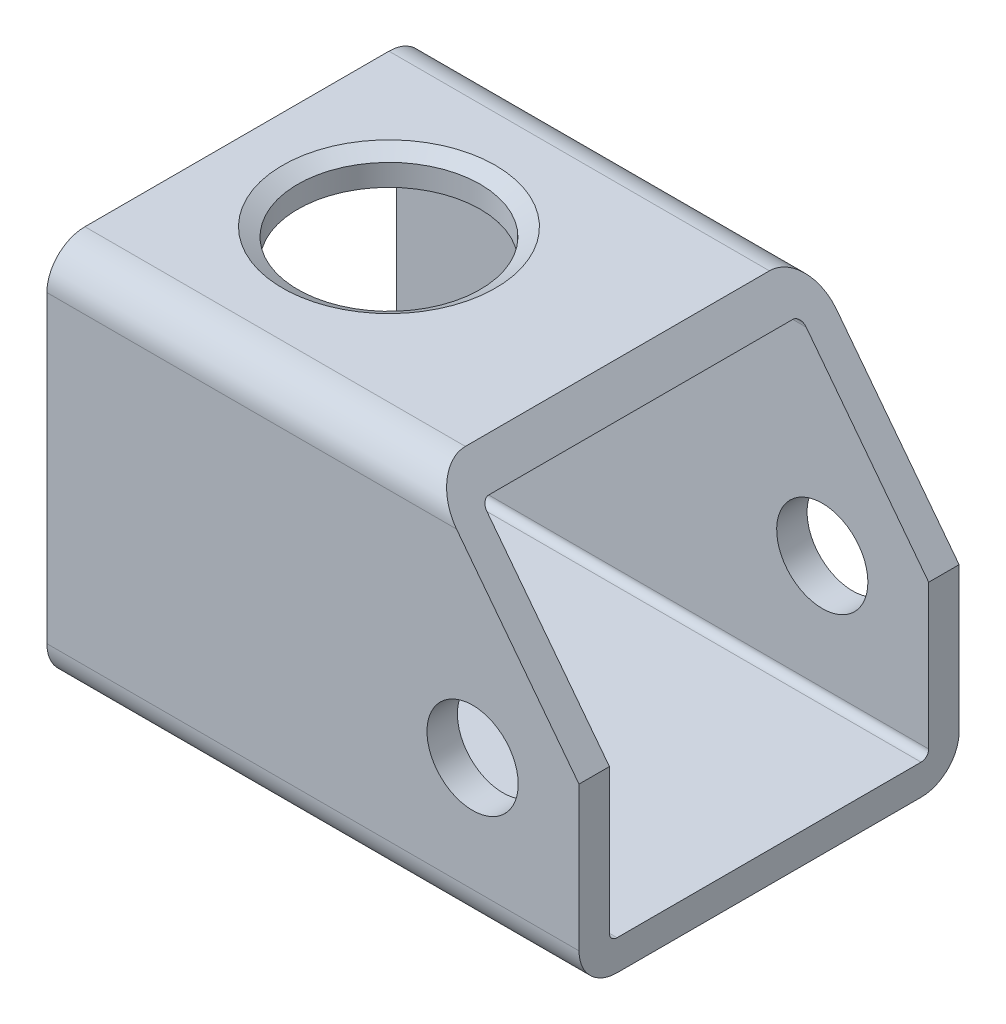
ISO-10303-21;
HEADER;
FILE_DESCRIPTION(('STEP AP214'),'2;1');
FILE_NAME('part.step','',(''),(''),'','','');
FILE_SCHEMA(('AUTOMOTIVE_DESIGN { 1 0 10303 214 1 1 1 1 }'));
ENDSEC;
DATA;
#1=APPLICATION_CONTEXT('core data for automotive mechanical design processes');
#2=APPLICATION_PROTOCOL_DEFINITION('international standard','automotive_design',2000,#1);
#3=PRODUCT_CONTEXT('',#1,'mechanical');
#4=PRODUCT('Part','Part','',(#3));
#5=PRODUCT_RELATED_PRODUCT_CATEGORY('part','',(#4));
#6=PRODUCT_DEFINITION_FORMATION('','',#4);
#7=PRODUCT_DEFINITION_CONTEXT('part definition',#1,'design');
#8=PRODUCT_DEFINITION('design','',#6,#7);
#9=PRODUCT_DEFINITION_SHAPE('','',#8);
#10=(LENGTH_UNIT() NAMED_UNIT(*) SI_UNIT(.MILLI.,.METRE.));
#11=(NAMED_UNIT(*) PLANE_ANGLE_UNIT() SI_UNIT($,.RADIAN.));
#12=(NAMED_UNIT(*) SI_UNIT($,.STERADIAN.) SOLID_ANGLE_UNIT());
#13=UNCERTAINTY_MEASURE_WITH_UNIT(LENGTH_MEASURE(1.E-05),#10,'distance_accuracy_value','');
#14=(GEOMETRIC_REPRESENTATION_CONTEXT(3) GLOBAL_UNCERTAINTY_ASSIGNED_CONTEXT((#13)) GLOBAL_UNIT_ASSIGNED_CONTEXT((#10,
#11,#12)) REPRESENTATION_CONTEXT('',''));
#15=CARTESIAN_POINT('',(0.,0.,0.));
#16=DIRECTION('',(0.,0.,1.));
#17=DIRECTION('',(1.,0.,0.));
#18=AXIS2_PLACEMENT_3D('',#15,#16,#17);
#19=CARTESIAN_POINT('',(35.,-10.,10.));
#20=DIRECTION('',(1.,0.,0.));
#21=DIRECTION('',(0.,0.,-1.));
#22=AXIS2_PLACEMENT_3D('',#19,#20,#21);
#23=PLANE('',#22);
#24=DIRECTION('',(0.,1.,0.));
#25=VECTOR('',#24,1.);
#26=CARTESIAN_POINT('',(35.,9.99999999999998,-12.5));
#27=LINE('',#26,#25);
#28=CARTESIAN_POINT('',(35.,-9.99999999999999,-12.5));
#29=VERTEX_POINT('',#28);
#30=CARTESIAN_POINT('',(35.,-0.500000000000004,-12.5));
#31=VERTEX_POINT('',#30);
#32=EDGE_CURVE('E296',#29,#31,#27,.T.);
#33=ORIENTED_EDGE('',*,*,#32,.T.);
#34=DIRECTION('',(0.,0.,-1.));
#35=VECTOR('',#34,1.);
#36=CARTESIAN_POINT('',(35.,-0.500000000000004,77.8117148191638));
#37=LINE('',#36,#35);
#38=CARTESIAN_POINT('',(35.,-0.500000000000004,-10.5));
#39=VERTEX_POINT('',#38);
#40=EDGE_CURVE('E167',#39,#31,#37,.T.);
#41=ORIENTED_EDGE('',*,*,#40,.F.);
#42=DIRECTION('',(0.,1.,0.));
#43=VECTOR('',#42,1.);
#44=CARTESIAN_POINT('',(35.,9.99999999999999,-10.5));
#45=LINE('',#44,#43);
#46=CARTESIAN_POINT('',(35.,-10.,-10.5));
#47=VERTEX_POINT('',#46);
#48=EDGE_CURVE('E346',#47,#39,#45,.T.);
#49=ORIENTED_EDGE('',*,*,#48,.F.);
#50=CARTESIAN_POINT('',(35.,-10.,-10.));
#51=DIRECTION('',(1.,0.,0.));
#52=DIRECTION('',(0.,0.,-1.));
#53=AXIS2_PLACEMENT_3D('',#50,#51,#52);
#54=CIRCLE('',#53,0.5);
#55=CARTESIAN_POINT('',(35.,-10.5,-10.));
#56=VERTEX_POINT('',#55);
#57=EDGE_CURVE('E349',#56,#47,#54,.T.);
#58=ORIENTED_EDGE('',*,*,#57,.F.);
#59=DIRECTION('',(0.,0.,-1.));
#60=VECTOR('',#59,1.);
#61=CARTESIAN_POINT('',(35.,-10.5,9.99999999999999));
#62=LINE('',#61,#60);
#63=CARTESIAN_POINT('',(35.,-10.5,9.99999999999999));
#64=VERTEX_POINT('',#63);
#65=EDGE_CURVE('E351',#64,#56,#62,.T.);
#66=ORIENTED_EDGE('',*,*,#65,.F.);
#67=CARTESIAN_POINT('',(35.,-10.,10.));
#68=DIRECTION('',(1.,0.,0.));
#69=DIRECTION('',(0.,0.,-1.));
#70=AXIS2_PLACEMENT_3D('',#67,#68,#69);
#71=CIRCLE('',#70,0.5);
#72=CARTESIAN_POINT('',(35.,-10.,10.5));
#73=VERTEX_POINT('',#72);
#74=EDGE_CURVE('E324',#73,#64,#71,.T.);
#75=ORIENTED_EDGE('',*,*,#74,.F.);
#76=DIRECTION('',(0.,-1.,0.));
#77=VECTOR('',#76,1.);
#78=CARTESIAN_POINT('',(35.,9.99999999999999,10.5));
#79=LINE('',#78,#77);
#80=CARTESIAN_POINT('',(35.,-0.500000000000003,10.5));
#81=VERTEX_POINT('',#80);
#82=EDGE_CURVE('E320',#81,#73,#79,.T.);
#83=ORIENTED_EDGE('',*,*,#82,.F.);
#84=CARTESIAN_POINT('',(35.,-0.500000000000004,12.5));
#85=VERTEX_POINT('',#84);
#86=EDGE_CURVE('E47',#85,#81,#37,.T.);
#87=ORIENTED_EDGE('',*,*,#86,.F.);
#88=DIRECTION('',(0.,-1.,0.));
#89=VECTOR('',#88,1.);
#90=CARTESIAN_POINT('',(35.,9.99999999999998,12.5));
#91=LINE('',#90,#89);
#92=CARTESIAN_POINT('',(35.,-9.99999999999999,12.5));
#93=VERTEX_POINT('',#92);
#94=EDGE_CURVE('E281',#85,#93,#91,.T.);
#95=ORIENTED_EDGE('',*,*,#94,.T.);
#96=CARTESIAN_POINT('',(35.,-10.,10.));
#97=DIRECTION('',(1.,0.,0.));
#98=DIRECTION('',(0.,0.,-1.));
#99=AXIS2_PLACEMENT_3D('',#96,#97,#98);
#100=CIRCLE('',#99,2.5);
#101=CARTESIAN_POINT('',(35.,-12.5,9.99999999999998));
#102=VERTEX_POINT('',#101);
#103=EDGE_CURVE('E295',#93,#102,#100,.T.);
#104=ORIENTED_EDGE('',*,*,#103,.T.);
#105=DIRECTION('',(0.,0.,-1.));
#106=VECTOR('',#105,1.);
#107=CARTESIAN_POINT('',(35.,-12.5,9.99999999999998));
#108=LINE('',#107,#106);
#109=CARTESIAN_POINT('',(35.,-12.5,-9.99999999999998));
#110=VERTEX_POINT('',#109);
#111=EDGE_CURVE('E302',#102,#110,#108,.T.);
#112=ORIENTED_EDGE('',*,*,#111,.T.);
#113=CARTESIAN_POINT('',(35.,-10.,-10.));
#114=DIRECTION('',(1.,0.,0.));
#115=DIRECTION('',(0.,0.,-1.));
#116=AXIS2_PLACEMENT_3D('',#113,#114,#115);
#117=CIRCLE('',#116,2.5);
#118=EDGE_CURVE('E299',#110,#29,#117,.T.);
#119=ORIENTED_EDGE('',*,*,#118,.T.);
#120=EDGE_LOOP('',(#33,#41,#49,#58,#66,#75,#83,#87,#95,#104,#112,#119));
#121=FACE_BOUND('',#120,.T.);
#122=ADVANCED_FACE('F32',(#121),#23,.T.);
#123=CARTESIAN_POINT('',(35.,9.99999999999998,-12.5));
#124=DIRECTION('',(0.,0.,1.));
#125=DIRECTION('',(0.,-1.,0.));
#126=AXIS2_PLACEMENT_3D('',#123,#124,#125);
#127=PLANE('',#126);
#128=CARTESIAN_POINT('',(28.,-2.5,-12.5));
#129=DIRECTION('',(0.,0.,1.));
#130=DIRECTION('',(1.,0.,0.));
#131=AXIS2_PLACEMENT_3D('',#128,#129,#130);
#132=CIRCLE('',#131,3.);
#133=CARTESIAN_POINT('',(31.,-2.5,-12.5));
#134=VERTEX_POINT('',#133);
#135=EDGE_CURVE('E205',#134,#134,#132,.T.);
#136=ORIENTED_EDGE('',*,*,#135,.T.);
#137=EDGE_LOOP('',(#136));
#138=FACE_BOUND('',#137,.T.);
#139=DIRECTION('',(-0.608761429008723,0.793353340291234,0.));
#140=VECTOR('',#139,1.);
#141=CARTESIAN_POINT('',(29.9288894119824,6.10879998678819,-12.5));
#142=LINE('',#141,#140);
#143=CARTESIAN_POINT('',(26.9430666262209,9.99999999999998,-12.5));
#144=VERTEX_POINT('',#143);
#145=EDGE_CURVE('E344',#31,#144,#142,.T.);
#146=ORIENTED_EDGE('',*,*,#145,.F.);
#147=ORIENTED_EDGE('',*,*,#32,.F.);
#148=DIRECTION('',(-1.,0.,0.));
#149=VECTOR('',#148,1.);
#150=CARTESIAN_POINT('',(35.,-9.99999999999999,-12.5));
#151=LINE('',#150,#149);
#152=CARTESIAN_POINT('',(0.,-9.99999999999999,-12.5));
#153=VERTEX_POINT('',#152);
#154=EDGE_CURVE('E192',#29,#153,#151,.T.);
#155=ORIENTED_EDGE('',*,*,#154,.T.);
#156=DIRECTION('',(0.,1.,0.));
#157=VECTOR('',#156,1.);
#158=CARTESIAN_POINT('',(0.,9.99999999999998,-12.5));
#159=LINE('',#158,#157);
#160=CARTESIAN_POINT('',(0.,9.99999999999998,-12.5));
#161=VERTEX_POINT('',#160);
#162=EDGE_CURVE('E285',#153,#161,#159,.T.);
#163=ORIENTED_EDGE('',*,*,#162,.T.);
#164=DIRECTION('',(-1.,0.,0.));
#165=VECTOR('',#164,1.);
#166=CARTESIAN_POINT('',(35.,9.99999999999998,-12.5));
#167=LINE('',#166,#165);
#168=EDGE_CURVE('E185',#144,#161,#167,.T.);
#169=ORIENTED_EDGE('',*,*,#168,.F.);
#170=EDGE_LOOP('',(#146,#147,#155,#163,#169));
#171=FACE_BOUND('',#170,.T.);
#172=ADVANCED_FACE('F221',(#138,#171),#127,.F.);
#173=CARTESIAN_POINT('',(35.,10.,-10.));
#174=DIRECTION('',(-1.,0.,0.));
#175=DIRECTION('',(0.,0.,1.));
#176=AXIS2_PLACEMENT_3D('',#173,#174,#175);
#177=CYLINDRICAL_SURFACE('',#176,2.5);
#178=CARTESIAN_POINT('',(26.9430666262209,10.,-10.));
#179=DIRECTION('',(0.793353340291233,0.608761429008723,0.));
#180=DIRECTION('',(-0.608761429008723,0.793353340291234,0.));
#181=AXIS2_PLACEMENT_3D('',#178,#179,#180);
#182=ELLIPSE('',#181,3.15118103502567,2.5);
#183=CARTESIAN_POINT('',(25.0247491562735,12.5,-9.99999999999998));
#184=VERTEX_POINT('',#183);
#185=EDGE_CURVE('E163',#144,#184,#182,.T.);
#186=ORIENTED_EDGE('',*,*,#185,.F.);
#187=ORIENTED_EDGE('',*,*,#168,.T.);
#188=CARTESIAN_POINT('',(0.,10.,-10.));
#189=DIRECTION('',(1.,0.,0.));
#190=DIRECTION('',(0.,0.,1.));
#191=AXIS2_PLACEMENT_3D('',#188,#189,#190);
#192=CIRCLE('',#191,2.5);
#193=CARTESIAN_POINT('',(0.,12.5,-9.99999999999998));
#194=VERTEX_POINT('',#193);
#195=EDGE_CURVE('E288',#161,#194,#192,.T.);
#196=ORIENTED_EDGE('',*,*,#195,.T.);
#197=DIRECTION('',(-1.,0.,0.));
#198=VECTOR('',#197,1.);
#199=CARTESIAN_POINT('',(35.,12.5,-9.99999999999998));
#200=LINE('',#199,#198);
#201=EDGE_CURVE('E183',#184,#194,#200,.T.);
#202=ORIENTED_EDGE('',*,*,#201,.F.);
#203=EDGE_LOOP('',(#186,#187,#196,#202));
#204=FACE_BOUND('',#203,.T.);
#205=ADVANCED_FACE('F227',(#204),#177,.T.);
#206=CARTESIAN_POINT('',(35.,12.5,9.99999999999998));
#207=DIRECTION('',(0.,-1.,0.));
#208=DIRECTION('',(0.,0.,-1.));
#209=AXIS2_PLACEMENT_3D('',#206,#207,#208);
#210=PLANE('',#209);
#211=CARTESIAN_POINT('',(10.,12.5,0.));
#212=DIRECTION('',(0.,-1.,0.));
#213=DIRECTION('',(0.,0.,-1.));
#214=AXIS2_PLACEMENT_3D('',#211,#212,#213);
#215=CIRCLE('',#214,6.99999999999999);
#216=CARTESIAN_POINT('',(10.,12.5,-6.99999999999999));
#217=VERTEX_POINT('',#216);
#218=EDGE_CURVE('E11',#217,#217,#215,.T.);
#219=ORIENTED_EDGE('',*,*,#218,.T.);
#220=EDGE_LOOP('',(#219));
#221=FACE_BOUND('',#220,.T.);
#222=DIRECTION('',(0.,0.,-1.));
#223=VECTOR('',#222,1.);
#224=CARTESIAN_POINT('',(25.0247491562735,12.5,77.8117148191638));
#225=LINE('',#224,#223);
#226=CARTESIAN_POINT('',(25.0247491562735,12.5,10.));
#227=VERTEX_POINT('',#226);
#228=EDGE_CURVE('E157',#227,#184,#225,.T.);
#229=ORIENTED_EDGE('',*,*,#228,.T.);
#230=ORIENTED_EDGE('',*,*,#201,.T.);
#231=DIRECTION('',(0.,0.,1.));
#232=VECTOR('',#231,1.);
#233=CARTESIAN_POINT('',(0.,12.5,9.99999999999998));
#234=LINE('',#233,#232);
#235=CARTESIAN_POINT('',(0.,12.5,9.99999999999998));
#236=VERTEX_POINT('',#235);
#237=EDGE_CURVE('E181',#194,#236,#234,.T.);
#238=ORIENTED_EDGE('',*,*,#237,.T.);
#239=DIRECTION('',(-1.,0.,0.));
#240=VECTOR('',#239,1.);
#241=CARTESIAN_POINT('',(35.,12.5,9.99999999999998));
#242=LINE('',#241,#240);
#243=EDGE_CURVE('E174',#227,#236,#242,.T.);
#244=ORIENTED_EDGE('',*,*,#243,.F.);
#245=EDGE_LOOP('',(#229,#230,#238,#244));
#246=FACE_BOUND('',#245,.T.);
#247=ADVANCED_FACE('F179',(#221,#246),#210,.F.);
#248=CARTESIAN_POINT('',(35.,10.,10.));
#249=DIRECTION('',(-1.,0.,0.));
#250=DIRECTION('',(0.,0.,1.));
#251=AXIS2_PLACEMENT_3D('',#248,#249,#250);
#252=CYLINDRICAL_SURFACE('',#251,2.5);
#253=CARTESIAN_POINT('',(26.9430666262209,10.,10.));
#254=DIRECTION('',(0.793353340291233,0.608761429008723,0.));
#255=DIRECTION('',(-0.608761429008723,0.793353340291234,0.));
#256=AXIS2_PLACEMENT_3D('',#253,#254,#255);
#257=ELLIPSE('',#256,3.15118103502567,2.5);
#258=CARTESIAN_POINT('',(26.9430666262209,9.99999999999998,12.5));
#259=VERTEX_POINT('',#258);
#260=EDGE_CURVE('E160',#227,#259,#257,.T.);
#261=ORIENTED_EDGE('',*,*,#260,.F.);
#262=ORIENTED_EDGE('',*,*,#243,.T.);
#263=CARTESIAN_POINT('',(0.,10.,10.));
#264=DIRECTION('',(1.,0.,0.));
#265=DIRECTION('',(0.,0.,-1.));
#266=AXIS2_PLACEMENT_3D('',#263,#264,#265);
#267=CIRCLE('',#266,2.5);
#268=CARTESIAN_POINT('',(0.,9.99999999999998,12.5));
#269=VERTEX_POINT('',#268);
#270=EDGE_CURVE('E292',#236,#269,#267,.T.);
#271=ORIENTED_EDGE('',*,*,#270,.T.);
#272=DIRECTION('',(-1.,0.,0.));
#273=VECTOR('',#272,1.);
#274=CARTESIAN_POINT('',(35.,9.99999999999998,12.5));
#275=LINE('',#274,#273);
#276=EDGE_CURVE('E176',#259,#269,#275,.T.);
#277=ORIENTED_EDGE('',*,*,#276,.F.);
#278=EDGE_LOOP('',(#261,#262,#271,#277));
#279=FACE_BOUND('',#278,.T.);
#280=ADVANCED_FACE('F172',(#279),#252,.T.);
#281=CARTESIAN_POINT('',(35.,9.99999999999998,12.5));
#282=DIRECTION('',(0.,0.,-1.));
#283=DIRECTION('',(0.,1.,0.));
#284=AXIS2_PLACEMENT_3D('',#281,#282,#283);
#285=PLANE('',#284);
#286=CARTESIAN_POINT('',(28.,-2.5,12.5));
#287=DIRECTION('',(0.,0.,1.));
#288=DIRECTION('',(1.,0.,0.));
#289=AXIS2_PLACEMENT_3D('',#286,#287,#288);
#290=CIRCLE('',#289,3.);
#291=CARTESIAN_POINT('',(31.,-2.5,12.5));
#292=VERTEX_POINT('',#291);
#293=EDGE_CURVE('E372',#292,#292,#290,.T.);
#294=ORIENTED_EDGE('',*,*,#293,.F.);
#295=EDGE_LOOP('',(#294));
#296=FACE_BOUND('',#295,.T.);
#297=DIRECTION('',(0.608761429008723,-0.793353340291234,0.));
#298=VECTOR('',#297,1.);
#299=CARTESIAN_POINT('',(29.9288894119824,6.10879998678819,12.5));
#300=LINE('',#299,#298);
#301=EDGE_CURVE('E177',#259,#85,#300,.T.);
#302=ORIENTED_EDGE('',*,*,#301,.F.);
#303=ORIENTED_EDGE('',*,*,#276,.T.);
#304=DIRECTION('',(0.,-1.,0.));
#305=VECTOR('',#304,1.);
#306=CARTESIAN_POINT('',(0.,9.99999999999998,12.5));
#307=LINE('',#306,#305);
#308=CARTESIAN_POINT('',(0.,-9.99999999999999,12.5));
#309=VERTEX_POINT('',#308);
#310=EDGE_CURVE('E294',#269,#309,#307,.T.);
#311=ORIENTED_EDGE('',*,*,#310,.T.);
#312=DIRECTION('',(-1.,0.,0.));
#313=VECTOR('',#312,1.);
#314=CARTESIAN_POINT('',(35.,-9.99999999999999,12.5));
#315=LINE('',#314,#313);
#316=EDGE_CURVE('E187',#93,#309,#315,.T.);
#317=ORIENTED_EDGE('',*,*,#316,.F.);
#318=ORIENTED_EDGE('',*,*,#94,.F.);
#319=EDGE_LOOP('',(#302,#303,#311,#317,#318));
#320=FACE_BOUND('',#319,.T.);
#321=ADVANCED_FACE('F241',(#296,#320),#285,.F.);
#322=CARTESIAN_POINT('',(35.,9.99999999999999,-10.5));
#323=DIRECTION('',(0.,0.,1.));
#324=DIRECTION('',(0.,-1.,0.));
#325=AXIS2_PLACEMENT_3D('',#322,#323,#324);
#326=PLANE('',#325);
#327=CARTESIAN_POINT('',(28.,-2.5,-10.5));
#328=DIRECTION('',(0.,0.,1.));
#329=DIRECTION('',(0.,-1.,0.));
#330=AXIS2_PLACEMENT_3D('',#327,#328,#329);
#331=CIRCLE('',#330,3.);
#332=CARTESIAN_POINT('',(28.,-5.50000000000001,-10.5));
#333=VERTEX_POINT('',#332);
#334=EDGE_CURVE('E168',#333,#333,#331,.T.);
#335=ORIENTED_EDGE('',*,*,#334,.F.);
#336=EDGE_LOOP('',(#335));
#337=FACE_BOUND('',#336,.T.);
#338=ORIENTED_EDGE('',*,*,#48,.T.);
#339=DIRECTION('',(-0.608761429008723,0.793353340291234,0.));
#340=VECTOR('',#339,1.);
#341=CARTESIAN_POINT('',(29.9288894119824,6.1087999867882,-10.5));
#342=LINE('',#341,#340);
#343=CARTESIAN_POINT('',(26.9430666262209,9.99999999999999,-10.5));
#344=VERTEX_POINT('',#343);
#345=EDGE_CURVE('E357',#39,#344,#342,.T.);
#346=ORIENTED_EDGE('',*,*,#345,.T.);
#347=DIRECTION('',(-1.,0.,0.));
#348=VECTOR('',#347,1.);
#349=CARTESIAN_POINT('',(35.,9.99999999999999,-10.5));
#350=LINE('',#349,#348);
#351=CARTESIAN_POINT('',(0.,9.99999999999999,-10.5));
#352=VERTEX_POINT('',#351);
#353=EDGE_CURVE('E310',#344,#352,#350,.T.);
#354=ORIENTED_EDGE('',*,*,#353,.T.);
#355=DIRECTION('',(0.,1.,0.));
#356=VECTOR('',#355,1.);
#357=CARTESIAN_POINT('',(0.,9.99999999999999,-10.5));
#358=LINE('',#357,#356);
#359=CARTESIAN_POINT('',(0.,-10.,-10.5));
#360=VERTEX_POINT('',#359);
#361=EDGE_CURVE('E334',#360,#352,#358,.T.);
#362=ORIENTED_EDGE('',*,*,#361,.F.);
#363=DIRECTION('',(-1.,0.,0.));
#364=VECTOR('',#363,1.);
#365=CARTESIAN_POINT('',(35.,-10.,-10.5));
#366=LINE('',#365,#364);
#367=EDGE_CURVE('E308',#47,#360,#366,.T.);
#368=ORIENTED_EDGE('',*,*,#367,.F.);
#369=EDGE_LOOP('',(#338,#346,#354,#362,#368));
#370=FACE_BOUND('',#369,.T.);
#371=ADVANCED_FACE('F244',(#337,#370),#326,.T.);
#372=CARTESIAN_POINT('',(35.,10.,-10.));
#373=DIRECTION('',(-1.,0.,0.));
#374=DIRECTION('',(0.,0.,1.));
#375=AXIS2_PLACEMENT_3D('',#372,#373,#374);
#376=CYLINDRICAL_SURFACE('',#375,0.5);
#377=ORIENTED_EDGE('',*,*,#353,.F.);
#378=CARTESIAN_POINT('',(26.9430666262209,10.,-10.));
#379=DIRECTION('',(0.793353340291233,0.608761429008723,0.));
#380=DIRECTION('',(-0.608761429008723,0.793353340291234,0.));
#381=AXIS2_PLACEMENT_3D('',#378,#379,#380);
#382=ELLIPSE('',#381,0.630236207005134,0.5);
#383=CARTESIAN_POINT('',(26.5594031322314,10.5,-9.99999999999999));
#384=VERTEX_POINT('',#383);
#385=EDGE_CURVE('E360',#344,#384,#382,.T.);
#386=ORIENTED_EDGE('',*,*,#385,.T.);
#387=DIRECTION('',(-1.,0.,0.));
#388=VECTOR('',#387,1.);
#389=CARTESIAN_POINT('',(35.,10.5,-9.99999999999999));
#390=LINE('',#389,#388);
#391=CARTESIAN_POINT('',(0.,10.5,-9.99999999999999));
#392=VERTEX_POINT('',#391);
#393=EDGE_CURVE('E312',#384,#392,#390,.T.);
#394=ORIENTED_EDGE('',*,*,#393,.T.);
#395=CARTESIAN_POINT('',(0.,10.,-10.));
#396=DIRECTION('',(1.,0.,0.));
#397=DIRECTION('',(0.,0.,-1.));
#398=AXIS2_PLACEMENT_3D('',#395,#396,#397);
#399=CIRCLE('',#398,0.5);
#400=EDGE_CURVE('E331',#352,#392,#399,.T.);
#401=ORIENTED_EDGE('',*,*,#400,.F.);
#402=EDGE_LOOP('',(#377,#386,#394,#401));
#403=FACE_BOUND('',#402,.T.);
#404=ADVANCED_FACE('F385',(#403),#376,.F.);
#405=CARTESIAN_POINT('',(35.,10.5,10.));
#406=DIRECTION('',(0.,-1.,0.));
#407=DIRECTION('',(0.,0.,-1.));
#408=AXIS2_PLACEMENT_3D('',#405,#406,#407);
#409=PLANE('',#408);
#410=CARTESIAN_POINT('',(10.,10.5,0.));
#411=DIRECTION('',(0.,-1.,0.));
#412=DIRECTION('',(0.,0.,-1.));
#413=AXIS2_PLACEMENT_3D('',#410,#411,#412);
#414=CIRCLE('',#413,6.);
#415=CARTESIAN_POINT('',(10.,10.5,-6.));
#416=VERTEX_POINT('',#415);
#417=EDGE_CURVE('E375',#416,#416,#414,.F.);
#418=ORIENTED_EDGE('',*,*,#417,.T.);
#419=EDGE_LOOP('',(#418));
#420=FACE_BOUND('',#419,.T.);
#421=ORIENTED_EDGE('',*,*,#393,.F.);
#422=DIRECTION('',(0.,0.,1.));
#423=VECTOR('',#422,1.);
#424=CARTESIAN_POINT('',(26.5594031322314,10.5,10.));
#425=LINE('',#424,#423);
#426=CARTESIAN_POINT('',(26.5594031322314,10.5,10.));
#427=VERTEX_POINT('',#426);
#428=EDGE_CURVE('E363',#384,#427,#425,.T.);
#429=ORIENTED_EDGE('',*,*,#428,.T.);
#430=DIRECTION('',(-1.,0.,0.));
#431=VECTOR('',#430,1.);
#432=CARTESIAN_POINT('',(35.,10.5,10.));
#433=LINE('',#432,#431);
#434=CARTESIAN_POINT('',(0.,10.5,10.));
#435=VERTEX_POINT('',#434);
#436=EDGE_CURVE('E314',#427,#435,#433,.T.);
#437=ORIENTED_EDGE('',*,*,#436,.T.);
#438=DIRECTION('',(0.,0.,1.));
#439=VECTOR('',#438,1.);
#440=CARTESIAN_POINT('',(0.,10.5,10.));
#441=LINE('',#440,#439);
#442=EDGE_CURVE('E328',#392,#435,#441,.T.);
#443=ORIENTED_EDGE('',*,*,#442,.F.);
#444=EDGE_LOOP('',(#421,#429,#437,#443));
#445=FACE_BOUND('',#444,.T.);
#446=ADVANCED_FACE('F381',(#420,#445),#409,.T.);
#447=CARTESIAN_POINT('',(35.,10.,10.));
#448=DIRECTION('',(-1.,0.,0.));
#449=DIRECTION('',(0.,0.,1.));
#450=AXIS2_PLACEMENT_3D('',#447,#448,#449);
#451=CYLINDRICAL_SURFACE('',#450,0.5);
#452=ORIENTED_EDGE('',*,*,#436,.F.);
#453=CARTESIAN_POINT('',(26.9430666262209,10.,10.));
#454=DIRECTION('',(0.793353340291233,0.608761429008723,0.));
#455=DIRECTION('',(-0.608761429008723,0.793353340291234,0.));
#456=AXIS2_PLACEMENT_3D('',#453,#454,#455);
#457=ELLIPSE('',#456,0.630236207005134,0.5);
#458=CARTESIAN_POINT('',(26.9430666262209,9.99999999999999,10.5));
#459=VERTEX_POINT('',#458);
#460=EDGE_CURVE('E366',#427,#459,#457,.T.);
#461=ORIENTED_EDGE('',*,*,#460,.T.);
#462=DIRECTION('',(-1.,0.,0.));
#463=VECTOR('',#462,1.);
#464=CARTESIAN_POINT('',(35.,9.99999999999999,10.5));
#465=LINE('',#464,#463);
#466=CARTESIAN_POINT('',(0.,9.99999999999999,10.5));
#467=VERTEX_POINT('',#466);
#468=EDGE_CURVE('E316',#459,#467,#465,.T.);
#469=ORIENTED_EDGE('',*,*,#468,.T.);
#470=CARTESIAN_POINT('',(0.,10.,10.));
#471=DIRECTION('',(1.,0.,0.));
#472=DIRECTION('',(0.,0.,1.));
#473=AXIS2_PLACEMENT_3D('',#470,#471,#472);
#474=CIRCLE('',#473,0.5);
#475=EDGE_CURVE('E325',#435,#467,#474,.T.);
#476=ORIENTED_EDGE('',*,*,#475,.F.);
#477=EDGE_LOOP('',(#452,#461,#469,#476));
#478=FACE_BOUND('',#477,.T.);
#479=ADVANCED_FACE('F384',(#478),#451,.F.);
#480=CARTESIAN_POINT('',(35.,9.99999999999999,10.5));
#481=DIRECTION('',(0.,0.,-1.));
#482=DIRECTION('',(0.,1.,0.));
#483=AXIS2_PLACEMENT_3D('',#480,#481,#482);
#484=PLANE('',#483);
#485=CARTESIAN_POINT('',(28.,-2.5,10.5));
#486=DIRECTION('',(0.,0.,-1.));
#487=DIRECTION('',(0.,1.,0.));
#488=AXIS2_PLACEMENT_3D('',#485,#486,#487);
#489=CIRCLE('',#488,3.);
#490=CARTESIAN_POINT('',(28.,0.499999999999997,10.5));
#491=VERTEX_POINT('',#490);
#492=EDGE_CURVE('E203',#491,#491,#489,.T.);
#493=ORIENTED_EDGE('',*,*,#492,.F.);
#494=EDGE_LOOP('',(#493));
#495=FACE_BOUND('',#494,.T.);
#496=ORIENTED_EDGE('',*,*,#468,.F.);
#497=DIRECTION('',(0.608761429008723,-0.793353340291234,0.));
#498=VECTOR('',#497,1.);
#499=CARTESIAN_POINT('',(29.9288894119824,6.1087999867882,10.5));
#500=LINE('',#499,#498);
#501=EDGE_CURVE('E201',#459,#81,#500,.T.);
#502=ORIENTED_EDGE('',*,*,#501,.T.);
#503=ORIENTED_EDGE('',*,*,#82,.T.);
#504=DIRECTION('',(-1.,0.,0.));
#505=VECTOR('',#504,1.);
#506=CARTESIAN_POINT('',(35.,-10.,10.5));
#507=LINE('',#506,#505);
#508=CARTESIAN_POINT('',(0.,-10.,10.5));
#509=VERTEX_POINT('',#508);
#510=EDGE_CURVE('E318',#73,#509,#507,.T.);
#511=ORIENTED_EDGE('',*,*,#510,.T.);
#512=DIRECTION('',(0.,-1.,0.));
#513=VECTOR('',#512,1.);
#514=CARTESIAN_POINT('',(0.,9.99999999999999,10.5));
#515=LINE('',#514,#513);
#516=EDGE_CURVE('E321',#467,#509,#515,.T.);
#517=ORIENTED_EDGE('',*,*,#516,.F.);
#518=EDGE_LOOP('',(#496,#502,#503,#511,#517));
#519=FACE_BOUND('',#518,.T.);
#520=ADVANCED_FACE('F239',(#495,#519),#484,.T.);
#521=CARTESIAN_POINT('',(0.,-10.,10.));
#522=DIRECTION('',(1.,0.,0.));
#523=DIRECTION('',(0.,0.,-1.));
#524=AXIS2_PLACEMENT_3D('',#521,#522,#523);
#525=PLANE('',#524);
#526=CARTESIAN_POINT('',(0.,-10.,10.));
#527=DIRECTION('',(1.,0.,0.));
#528=DIRECTION('',(0.,0.,-1.));
#529=AXIS2_PLACEMENT_3D('',#526,#527,#528);
#530=CIRCLE('',#529,2.5);
#531=CARTESIAN_POINT('',(0.,-12.5,9.99999999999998));
#532=VERTEX_POINT('',#531);
#533=EDGE_CURVE('E269',#309,#532,#530,.T.);
#534=ORIENTED_EDGE('',*,*,#533,.F.);
#535=ORIENTED_EDGE('',*,*,#310,.F.);
#536=ORIENTED_EDGE('',*,*,#270,.F.);
#537=ORIENTED_EDGE('',*,*,#237,.F.);
#538=ORIENTED_EDGE('',*,*,#195,.F.);
#539=ORIENTED_EDGE('',*,*,#162,.F.);
#540=CARTESIAN_POINT('',(0.,-10.,-10.));
#541=DIRECTION('',(1.,0.,0.));
#542=DIRECTION('',(0.,0.,-1.));
#543=AXIS2_PLACEMENT_3D('',#540,#541,#542);
#544=CIRCLE('',#543,2.5);
#545=CARTESIAN_POINT('',(0.,-12.5,-9.99999999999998));
#546=VERTEX_POINT('',#545);
#547=EDGE_CURVE('E276',#546,#153,#544,.T.);
#548=ORIENTED_EDGE('',*,*,#547,.F.);
#549=DIRECTION('',(0.,0.,-1.));
#550=VECTOR('',#549,1.);
#551=CARTESIAN_POINT('',(0.,-12.5,9.99999999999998));
#552=LINE('',#551,#550);
#553=EDGE_CURVE('E273',#532,#546,#552,.T.);
#554=ORIENTED_EDGE('',*,*,#553,.F.);
#555=EDGE_LOOP('',(#534,#535,#536,#537,#538,#539,#548,#554));
#556=FACE_BOUND('',#555,.T.);
#557=CARTESIAN_POINT('',(0.,-10.,10.));
#558=DIRECTION('',(1.,0.,0.));
#559=DIRECTION('',(0.,0.,-1.));
#560=AXIS2_PLACEMENT_3D('',#557,#558,#559);
#561=CIRCLE('',#560,0.5);
#562=CARTESIAN_POINT('',(0.,-10.5,9.99999999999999));
#563=VERTEX_POINT('',#562);
#564=EDGE_CURVE('E55',#509,#563,#561,.T.);
#565=ORIENTED_EDGE('',*,*,#564,.T.);
#566=DIRECTION('',(0.,0.,-1.));
#567=VECTOR('',#566,1.);
#568=CARTESIAN_POINT('',(0.,-10.5,9.99999999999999));
#569=LINE('',#568,#567);
#570=CARTESIAN_POINT('',(0.,-10.5,-10.));
#571=VERTEX_POINT('',#570);
#572=EDGE_CURVE('E340',#563,#571,#569,.T.);
#573=ORIENTED_EDGE('',*,*,#572,.T.);
#574=CARTESIAN_POINT('',(0.,-10.,-10.));
#575=DIRECTION('',(1.,0.,0.));
#576=DIRECTION('',(0.,0.,-1.));
#577=AXIS2_PLACEMENT_3D('',#574,#575,#576);
#578=CIRCLE('',#577,0.5);
#579=EDGE_CURVE('E337',#571,#360,#578,.T.);
#580=ORIENTED_EDGE('',*,*,#579,.T.);
#581=ORIENTED_EDGE('',*,*,#361,.T.);
#582=ORIENTED_EDGE('',*,*,#400,.T.);
#583=ORIENTED_EDGE('',*,*,#442,.T.);
#584=ORIENTED_EDGE('',*,*,#475,.T.);
#585=ORIENTED_EDGE('',*,*,#516,.T.);
#586=EDGE_LOOP('',(#565,#573,#580,#581,#582,#583,#584,#585));
#587=FACE_BOUND('',#586,.T.);
#588=ADVANCED_FACE('F235',(#556,#587),#525,.F.);
#589=CARTESIAN_POINT('',(35.,-10.,10.));
#590=DIRECTION('',(-1.,0.,0.));
#591=DIRECTION('',(0.,0.,1.));
#592=AXIS2_PLACEMENT_3D('',#589,#590,#591);
#593=CYLINDRICAL_SURFACE('',#592,2.5);
#594=ORIENTED_EDGE('',*,*,#533,.T.);
#595=DIRECTION('',(-1.,0.,0.));
#596=VECTOR('',#595,1.);
#597=CARTESIAN_POINT('',(35.,-12.5,9.99999999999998));
#598=LINE('',#597,#596);
#599=EDGE_CURVE('E198',#102,#532,#598,.T.);
#600=ORIENTED_EDGE('',*,*,#599,.F.);
#601=ORIENTED_EDGE('',*,*,#103,.F.);
#602=ORIENTED_EDGE('',*,*,#316,.T.);
#603=EDGE_LOOP('',(#594,#600,#601,#602));
#604=FACE_BOUND('',#603,.T.);
#605=ADVANCED_FACE('F238',(#604),#593,.T.);
#606=CARTESIAN_POINT('',(35.,-12.5,9.99999999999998));
#607=DIRECTION('',(0.,1.,0.));
#608=DIRECTION('',(0.,0.,1.));
#609=AXIS2_PLACEMENT_3D('',#606,#607,#608);
#610=PLANE('',#609);
#611=ORIENTED_EDGE('',*,*,#553,.T.);
#612=DIRECTION('',(-1.,0.,0.));
#613=VECTOR('',#612,1.);
#614=CARTESIAN_POINT('',(35.,-12.5,-9.99999999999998));
#615=LINE('',#614,#613);
#616=EDGE_CURVE('E195',#110,#546,#615,.T.);
#617=ORIENTED_EDGE('',*,*,#616,.F.);
#618=ORIENTED_EDGE('',*,*,#111,.F.);
#619=ORIENTED_EDGE('',*,*,#599,.T.);
#620=EDGE_LOOP('',(#611,#617,#618,#619));
#621=FACE_BOUND('',#620,.T.);
#622=ADVANCED_FACE('F257',(#621),#610,.F.);
#623=CARTESIAN_POINT('',(35.,-10.,-10.));
#624=DIRECTION('',(-1.,0.,0.));
#625=DIRECTION('',(0.,0.,1.));
#626=AXIS2_PLACEMENT_3D('',#623,#624,#625);
#627=CYLINDRICAL_SURFACE('',#626,2.5);
#628=ORIENTED_EDGE('',*,*,#547,.T.);
#629=ORIENTED_EDGE('',*,*,#154,.F.);
#630=ORIENTED_EDGE('',*,*,#118,.F.);
#631=ORIENTED_EDGE('',*,*,#616,.T.);
#632=EDGE_LOOP('',(#628,#629,#630,#631));
#633=FACE_BOUND('',#632,.T.);
#634=ADVANCED_FACE('F254',(#633),#627,.T.);
#635=CARTESIAN_POINT('',(35.,-10.,10.));
#636=DIRECTION('',(-1.,0.,0.));
#637=DIRECTION('',(0.,0.,1.));
#638=AXIS2_PLACEMENT_3D('',#635,#636,#637);
#639=CYLINDRICAL_SURFACE('',#638,0.5);
#640=ORIENTED_EDGE('',*,*,#564,.F.);
#641=ORIENTED_EDGE('',*,*,#510,.F.);
#642=ORIENTED_EDGE('',*,*,#74,.T.);
#643=DIRECTION('',(-1.,0.,0.));
#644=VECTOR('',#643,1.);
#645=CARTESIAN_POINT('',(35.,-10.5,9.99999999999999));
#646=LINE('',#645,#644);
#647=EDGE_CURVE('E274',#64,#563,#646,.T.);
#648=ORIENTED_EDGE('',*,*,#647,.T.);
#649=EDGE_LOOP('',(#640,#641,#642,#648));
#650=FACE_BOUND('',#649,.T.);
#651=ADVANCED_FACE('F233',(#650),#639,.F.);
#652=CARTESIAN_POINT('',(35.,-10.5,9.99999999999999));
#653=DIRECTION('',(0.,1.,0.));
#654=DIRECTION('',(0.,0.,1.));
#655=AXIS2_PLACEMENT_3D('',#652,#653,#654);
#656=PLANE('',#655);
#657=ORIENTED_EDGE('',*,*,#572,.F.);
#658=ORIENTED_EDGE('',*,*,#647,.F.);
#659=ORIENTED_EDGE('',*,*,#65,.T.);
#660=DIRECTION('',(-1.,0.,0.));
#661=VECTOR('',#660,1.);
#662=CARTESIAN_POINT('',(35.,-10.5,-10.));
#663=LINE('',#662,#661);
#664=EDGE_CURVE('E278',#56,#571,#663,.T.);
#665=ORIENTED_EDGE('',*,*,#664,.T.);
#666=EDGE_LOOP('',(#657,#658,#659,#665));
#667=FACE_BOUND('',#666,.T.);
#668=ADVANCED_FACE('F413',(#667),#656,.T.);
#669=CARTESIAN_POINT('',(35.,-10.,-10.));
#670=DIRECTION('',(-1.,0.,0.));
#671=DIRECTION('',(0.,0.,1.));
#672=AXIS2_PLACEMENT_3D('',#669,#670,#671);
#673=CYLINDRICAL_SURFACE('',#672,0.5);
#674=ORIENTED_EDGE('',*,*,#579,.F.);
#675=ORIENTED_EDGE('',*,*,#664,.F.);
#676=ORIENTED_EDGE('',*,*,#57,.T.);
#677=ORIENTED_EDGE('',*,*,#367,.T.);
#678=EDGE_LOOP('',(#674,#675,#676,#677));
#679=FACE_BOUND('',#678,.T.);
#680=ADVANCED_FACE('F432',(#679),#673,.F.);
#681=CARTESIAN_POINT('',(25.0247491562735,12.5,77.8117148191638));
#682=DIRECTION('',(0.793353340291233,0.608761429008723,0.));
#683=DIRECTION('',(-0.608761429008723,0.793353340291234,0.));
#684=AXIS2_PLACEMENT_3D('',#681,#682,#683);
#685=PLANE('',#684);
#686=ORIENTED_EDGE('',*,*,#40,.T.);
#687=ORIENTED_EDGE('',*,*,#145,.T.);
#688=ORIENTED_EDGE('',*,*,#185,.T.);
#689=ORIENTED_EDGE('',*,*,#228,.F.);
#690=ORIENTED_EDGE('',*,*,#260,.T.);
#691=ORIENTED_EDGE('',*,*,#301,.T.);
#692=ORIENTED_EDGE('',*,*,#86,.T.);
#693=ORIENTED_EDGE('',*,*,#501,.F.);
#694=ORIENTED_EDGE('',*,*,#460,.F.);
#695=ORIENTED_EDGE('',*,*,#428,.F.);
#696=ORIENTED_EDGE('',*,*,#385,.F.);
#697=ORIENTED_EDGE('',*,*,#345,.F.);
#698=EDGE_LOOP('',(#686,#687,#688,#689,#690,#691,#692,#693,#694,#695,#696,#697));
#699=FACE_BOUND('',#698,.T.);
#700=ADVANCED_FACE('F159',(#699),#685,.T.);
#701=CARTESIAN_POINT('',(28.,-2.5,-12.5));
#702=DIRECTION('',(0.,0.,1.));
#703=DIRECTION('',(1.,0.,0.));
#704=AXIS2_PLACEMENT_3D('',#701,#702,#703);
#705=CYLINDRICAL_SURFACE('',#704,3.);
#706=ORIENTED_EDGE('',*,*,#492,.T.);
#707=EDGE_LOOP('',(#706));
#708=FACE_BOUND('',#707,.T.);
#709=ORIENTED_EDGE('',*,*,#293,.T.);
#710=EDGE_LOOP('',(#709));
#711=FACE_BOUND('',#710,.T.);
#712=ADVANCED_FACE('F476',(#708,#711),#705,.F.);
#713=ORIENTED_EDGE('',*,*,#334,.T.);
#714=EDGE_LOOP('',(#713));
#715=FACE_BOUND('',#714,.T.);
#716=ORIENTED_EDGE('',*,*,#135,.F.);
#717=EDGE_LOOP('',(#716));
#718=FACE_BOUND('',#717,.T.);
#719=ADVANCED_FACE('F217',(#715,#718),#705,.F.);
#720=CARTESIAN_POINT('',(10.,-12.501,0.));
#721=DIRECTION('',(0.,1.,0.));
#722=DIRECTION('',(0.,0.,1.));
#723=AXIS2_PLACEMENT_3D('',#720,#721,#722);
#724=CYLINDRICAL_SURFACE('',#723,6.);
#725=CARTESIAN_POINT('',(10.,11.9226497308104,0.));
#726=DIRECTION('',(0.,-1.,0.));
#727=DIRECTION('',(0.,0.,-1.));
#728=AXIS2_PLACEMENT_3D('',#725,#726,#727);
#729=CIRCLE('',#728,6.);
#730=CARTESIAN_POINT('',(10.,11.9226497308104,-6.));
#731=VERTEX_POINT('',#730);
#732=EDGE_CURVE('E40',#731,#731,#729,.F.);
#733=ORIENTED_EDGE('',*,*,#732,.T.);
#734=EDGE_LOOP('',(#733));
#735=FACE_BOUND('',#734,.T.);
#736=ORIENTED_EDGE('',*,*,#417,.F.);
#737=EDGE_LOOP('',(#736));
#738=FACE_BOUND('',#737,.T.);
#739=ADVANCED_FACE('F209',(#735,#738),#724,.F.);
#740=CARTESIAN_POINT('',(10.,11.9226497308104,0.));
#741=DIRECTION('',(0.,1.,0.));
#742=DIRECTION('',(0.,0.,1.));
#743=AXIS2_PLACEMENT_3D('',#740,#741,#742);
#744=CONICAL_SURFACE('',#743,6.,1.0471975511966);
#745=ORIENTED_EDGE('',*,*,#218,.F.);
#746=EDGE_LOOP('',(#745));
#747=FACE_BOUND('',#746,.T.);
#748=ORIENTED_EDGE('',*,*,#732,.F.);
#749=EDGE_LOOP('',(#748));
#750=FACE_BOUND('',#749,.T.);
#751=ADVANCED_FACE('F34',(#747,#750),#744,.F.);
#752=CLOSED_SHELL('',(#122,#172,#205,#247,#280,#321,#371,#404,#446,#479,#520,#588,#605,#622,
#634,#651,#668,#680,#700,#712,#719,#739,#751));
#753=MANIFOLD_SOLID_BREP('B2',#752);
#754=ADVANCED_BREP_SHAPE_REPRESENTATION('',(#18,#753),#14);
#755=SHAPE_DEFINITION_REPRESENTATION(#9,#754);
ENDSEC;
END-ISO-10303-21;
